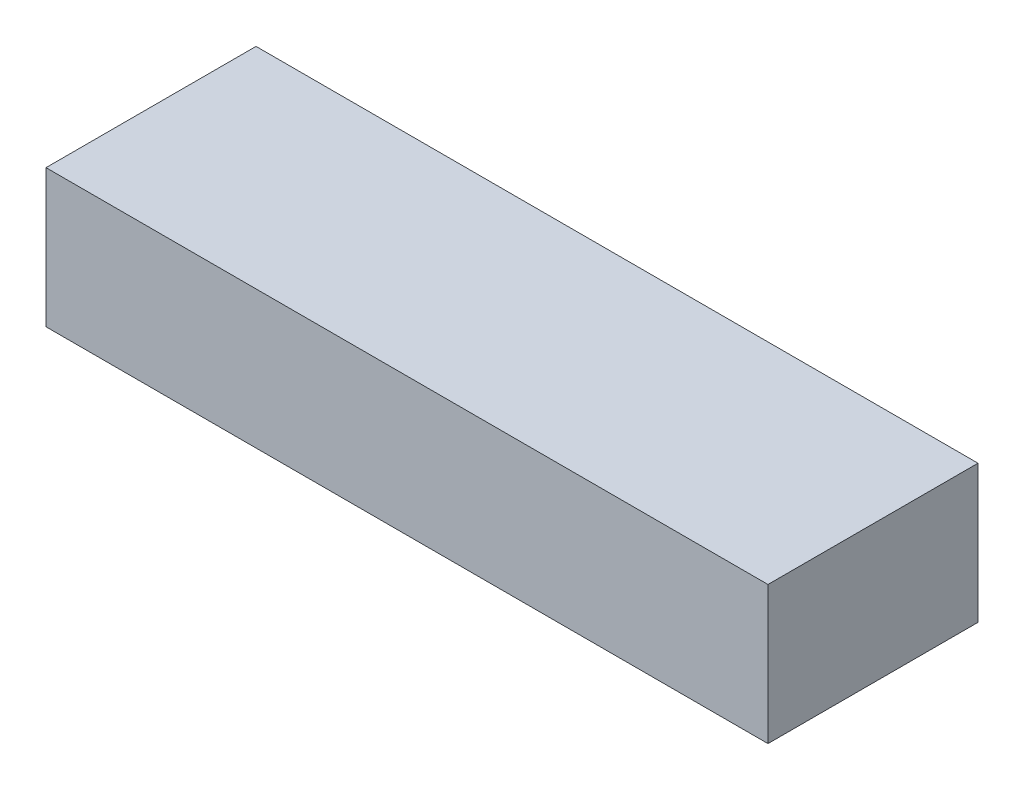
ISO-10303-21;
HEADER;
FILE_DESCRIPTION(('STEP AP214'),'2;1');
FILE_NAME('part.step','',(''),(''),'','','');
FILE_SCHEMA(('AUTOMOTIVE_DESIGN { 1 0 10303 214 1 1 1 1 }'));
ENDSEC;
DATA;
#1=APPLICATION_CONTEXT('core data for automotive mechanical design processes');
#2=APPLICATION_PROTOCOL_DEFINITION('international standard','automotive_design',2000,#1);
#3=PRODUCT_CONTEXT('',#1,'mechanical');
#4=PRODUCT('Part','Part','',(#3));
#5=PRODUCT_RELATED_PRODUCT_CATEGORY('part','',(#4));
#6=PRODUCT_DEFINITION_FORMATION('','',#4);
#7=PRODUCT_DEFINITION_CONTEXT('part definition',#1,'design');
#8=PRODUCT_DEFINITION('design','',#6,#7);
#9=PRODUCT_DEFINITION_SHAPE('','',#8);
#10=(LENGTH_UNIT() NAMED_UNIT(*) SI_UNIT(.MILLI.,.METRE.));
#11=(NAMED_UNIT(*) PLANE_ANGLE_UNIT() SI_UNIT($,.RADIAN.));
#12=(NAMED_UNIT(*) SI_UNIT($,.STERADIAN.) SOLID_ANGLE_UNIT());
#13=UNCERTAINTY_MEASURE_WITH_UNIT(LENGTH_MEASURE(1.E-05),#10,'distance_accuracy_value','');
#14=(GEOMETRIC_REPRESENTATION_CONTEXT(3) GLOBAL_UNCERTAINTY_ASSIGNED_CONTEXT((#13)) GLOBAL_UNIT_ASSIGNED_CONTEXT((#10,
#11,#12)) REPRESENTATION_CONTEXT('',''));
#15=CARTESIAN_POINT('',(0.,0.,0.));
#16=DIRECTION('',(0.,0.,1.));
#17=DIRECTION('',(1.,0.,0.));
#18=AXIS2_PLACEMENT_3D('',#15,#16,#17);
#19=CARTESIAN_POINT('',(55.,21.,-16.));
#20=DIRECTION('',(-1.,0.,0.));
#21=DIRECTION('',(0.,0.,1.));
#22=AXIS2_PLACEMENT_3D('',#19,#20,#21);
#23=PLANE('',#22);
#24=DIRECTION('',(0.,0.,-1.));
#25=VECTOR('',#24,1.);
#26=CARTESIAN_POINT('',(55.,0.,-16.));
#27=LINE('',#26,#25);
#28=CARTESIAN_POINT('',(55.,0.,16.));
#29=VERTEX_POINT('',#28);
#30=CARTESIAN_POINT('',(55.,0.,-16.));
#31=VERTEX_POINT('',#30);
#32=EDGE_CURVE('E97',#29,#31,#27,.T.);
#33=ORIENTED_EDGE('',*,*,#32,.T.);
#34=DIRECTION('',(0.,-1.,0.));
#35=VECTOR('',#34,1.);
#36=CARTESIAN_POINT('',(55.,21.,-16.));
#37=LINE('',#36,#35);
#38=CARTESIAN_POINT('',(55.,21.,-16.));
#39=VERTEX_POINT('',#38);
#40=EDGE_CURVE('E11',#39,#31,#37,.T.);
#41=ORIENTED_EDGE('',*,*,#40,.F.);
#42=DIRECTION('',(0.,0.,-1.));
#43=VECTOR('',#42,1.);
#44=CARTESIAN_POINT('',(55.,21.,-16.));
#45=LINE('',#44,#43);
#46=CARTESIAN_POINT('',(55.,21.,16.));
#47=VERTEX_POINT('',#46);
#48=EDGE_CURVE('E85',#47,#39,#45,.T.);
#49=ORIENTED_EDGE('',*,*,#48,.F.);
#50=DIRECTION('',(0.,-1.,0.));
#51=VECTOR('',#50,1.);
#52=CARTESIAN_POINT('',(55.,21.,16.));
#53=LINE('',#52,#51);
#54=EDGE_CURVE('E93',#47,#29,#53,.T.);
#55=ORIENTED_EDGE('',*,*,#54,.T.);
#56=EDGE_LOOP('',(#33,#41,#49,#55));
#57=FACE_BOUND('',#56,.T.);
#58=ADVANCED_FACE('F34',(#57),#23,.F.);
#59=CARTESIAN_POINT('',(-55.,21.,-16.));
#60=DIRECTION('',(0.,0.,1.));
#61=DIRECTION('',(1.,0.,0.));
#62=AXIS2_PLACEMENT_3D('',#59,#60,#61);
#63=PLANE('',#62);
#64=DIRECTION('',(-1.,0.,0.));
#65=VECTOR('',#64,1.);
#66=CARTESIAN_POINT('',(-55.,0.,-16.));
#67=LINE('',#66,#65);
#68=CARTESIAN_POINT('',(-55.,0.,-16.));
#69=VERTEX_POINT('',#68);
#70=EDGE_CURVE('E89',#31,#69,#67,.T.);
#71=ORIENTED_EDGE('',*,*,#70,.T.);
#72=DIRECTION('',(0.,-1.,0.));
#73=VECTOR('',#72,1.);
#74=CARTESIAN_POINT('',(-55.,21.,-16.));
#75=LINE('',#74,#73);
#76=CARTESIAN_POINT('',(-55.,21.,-16.));
#77=VERTEX_POINT('',#76);
#78=EDGE_CURVE('E42',#77,#69,#75,.T.);
#79=ORIENTED_EDGE('',*,*,#78,.F.);
#80=DIRECTION('',(-1.,0.,0.));
#81=VECTOR('',#80,1.);
#82=CARTESIAN_POINT('',(-55.,21.,-16.));
#83=LINE('',#82,#81);
#84=EDGE_CURVE('E80',#39,#77,#83,.T.);
#85=ORIENTED_EDGE('',*,*,#84,.F.);
#86=ORIENTED_EDGE('',*,*,#40,.T.);
#87=EDGE_LOOP('',(#71,#79,#85,#86));
#88=FACE_BOUND('',#87,.T.);
#89=ADVANCED_FACE('F88',(#88),#63,.F.);
#90=CARTESIAN_POINT('',(-55.,21.,-16.));
#91=DIRECTION('',(1.,0.,0.));
#92=DIRECTION('',(0.,0.,-1.));
#93=AXIS2_PLACEMENT_3D('',#90,#91,#92);
#94=PLANE('',#93);
#95=DIRECTION('',(0.,0.,1.));
#96=VECTOR('',#95,1.);
#97=CARTESIAN_POINT('',(-55.,0.,-16.));
#98=LINE('',#97,#96);
#99=CARTESIAN_POINT('',(-55.,0.,16.));
#100=VERTEX_POINT('',#99);
#101=EDGE_CURVE('E67',#69,#100,#98,.T.);
#102=ORIENTED_EDGE('',*,*,#101,.T.);
#103=DIRECTION('',(0.,-1.,0.));
#104=VECTOR('',#103,1.);
#105=CARTESIAN_POINT('',(-55.,21.,16.));
#106=LINE('',#105,#104);
#107=CARTESIAN_POINT('',(-55.,21.,16.));
#108=VERTEX_POINT('',#107);
#109=EDGE_CURVE('E90',#108,#100,#106,.T.);
#110=ORIENTED_EDGE('',*,*,#109,.F.);
#111=DIRECTION('',(0.,0.,1.));
#112=VECTOR('',#111,1.);
#113=CARTESIAN_POINT('',(-55.,21.,-16.));
#114=LINE('',#113,#112);
#115=EDGE_CURVE('E83',#77,#108,#114,.T.);
#116=ORIENTED_EDGE('',*,*,#115,.F.);
#117=ORIENTED_EDGE('',*,*,#78,.T.);
#118=EDGE_LOOP('',(#102,#110,#116,#117));
#119=FACE_BOUND('',#118,.T.);
#120=ADVANCED_FACE('F91',(#119),#94,.F.);
#121=CARTESIAN_POINT('',(-55.,21.,16.));
#122=DIRECTION('',(0.,0.,-1.));
#123=DIRECTION('',(-1.,0.,0.));
#124=AXIS2_PLACEMENT_3D('',#121,#122,#123);
#125=PLANE('',#124);
#126=DIRECTION('',(1.,0.,0.));
#127=VECTOR('',#126,1.);
#128=CARTESIAN_POINT('',(-55.,0.,16.));
#129=LINE('',#128,#127);
#130=EDGE_CURVE('E73',#100,#29,#129,.T.);
#131=ORIENTED_EDGE('',*,*,#130,.T.);
#132=ORIENTED_EDGE('',*,*,#54,.F.);
#133=DIRECTION('',(1.,0.,0.));
#134=VECTOR('',#133,1.);
#135=CARTESIAN_POINT('',(-55.,21.,16.));
#136=LINE('',#135,#134);
#137=EDGE_CURVE('E50',#108,#47,#136,.T.);
#138=ORIENTED_EDGE('',*,*,#137,.F.);
#139=ORIENTED_EDGE('',*,*,#109,.T.);
#140=EDGE_LOOP('',(#131,#132,#138,#139));
#141=FACE_BOUND('',#140,.T.);
#142=ADVANCED_FACE('F104',(#141),#125,.F.);
#143=CARTESIAN_POINT('',(0.,21.,0.));
#144=DIRECTION('',(0.,1.,0.));
#145=DIRECTION('',(0.,0.,1.));
#146=AXIS2_PLACEMENT_3D('',#143,#144,#145);
#147=PLANE('',#146);
#148=ORIENTED_EDGE('',*,*,#48,.T.);
#149=ORIENTED_EDGE('',*,*,#84,.T.);
#150=ORIENTED_EDGE('',*,*,#115,.T.);
#151=ORIENTED_EDGE('',*,*,#137,.T.);
#152=EDGE_LOOP('',(#148,#149,#150,#151));
#153=FACE_BOUND('',#152,.T.);
#154=ADVANCED_FACE('F81',(#153),#147,.T.);
#155=CARTESIAN_POINT('',(0.,0.,0.));
#156=DIRECTION('',(0.,1.,0.));
#157=DIRECTION('',(0.,0.,1.));
#158=AXIS2_PLACEMENT_3D('',#155,#156,#157);
#159=PLANE('',#158);
#160=ORIENTED_EDGE('',*,*,#32,.F.);
#161=ORIENTED_EDGE('',*,*,#130,.F.);
#162=ORIENTED_EDGE('',*,*,#101,.F.);
#163=ORIENTED_EDGE('',*,*,#70,.F.);
#164=EDGE_LOOP('',(#160,#161,#162,#163));
#165=FACE_BOUND('',#164,.T.);
#166=ADVANCED_FACE('F107',(#165),#159,.F.);
#167=CLOSED_SHELL('',(#58,#89,#120,#142,#154,#166));
#168=MANIFOLD_SOLID_BREP('B2',#167);
#169=ADVANCED_BREP_SHAPE_REPRESENTATION('',(#18,#168),#14);
#170=SHAPE_DEFINITION_REPRESENTATION(#9,#169);
ENDSEC;
END-ISO-10303-21;
